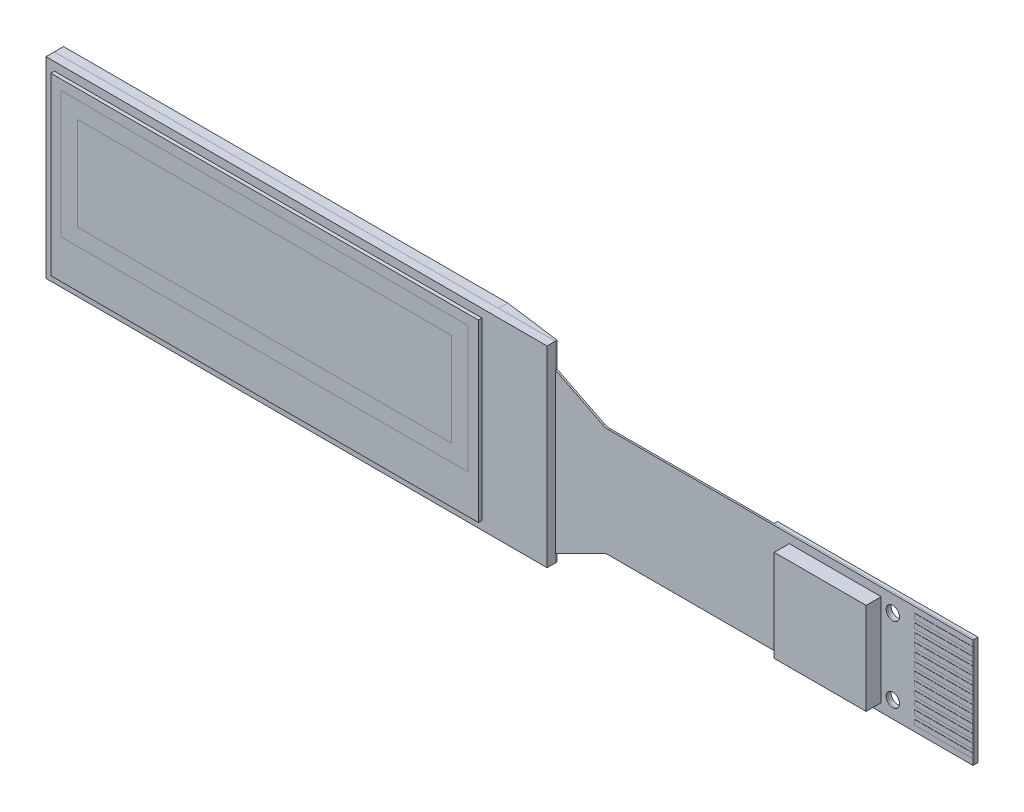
from build123d import *

# Parameters (mm, degrees)
SKETCH1_W                      = 26.6
SKETCH1_H                      = 11.5
SKETCH1_W_2                    = 25.6
SKETCH1_H_2                    = 10.5
SKETCH1_W_3                    = 24.384
SKETCH1_H_3                    = 7.584
SKETCH1_W_4                    = 22.384
SKETCH1_H_4                    = 5.584
SKETCH1_W_5                    = 3.4
TOP_GLASS_DEPTH                = 0.5
SKETCH1_3_W                    = 26.6
SKETCH1_3_H                    = 11.5
SKETCH1_3_W_2                  = 25.6
SKETCH1_3_H_2                  = 10.5
SKETCH1_3_W_3                  = 24.384
SKETCH1_3_H_3                  = 7.584
SKETCH1_3_W_4                  = 22.384
SKETCH1_3_H_4                  = 5.584
BACK_GLASS_DEPTH               = 0.55
POLARIZER_START                = 0.5
SKETCH1_4_W                    = 25.6
SKETCH1_4_H                    = 10.5
SKETCH1_4_W_2                  = 24.384
SKETCH1_4_H_2                  = 7.584
SKETCH1_4_W_3                  = 22.384
SKETCH1_4_H_3                  = 5.584
POLARIZER_DEPTH                = 0.21
SKETCH2_R                      = 0.4
FLEXIBLE_TAIL_DEPTH            = 0.1
STIFFENER_START                = -0.1
SKETCH2_4_W                    = 12
SKETCH2_4_H                    = 6.5
SKETCH2_4_R                    = 0.4
STIFFENER_DEPTH                = 0.2
SKETCH2_5_W                    = 3.5
SKETCH2_5_H                    = 0.3
PINS_DEPTH                     = 0.01
SKETCH2_6_W                    = 5.5
SKETCH2_6_H                    = 5.5
COMPONENTS_DEPTH               = 0.9
SILICON_GLUE_REACH             = 42.421
SILICON_GLUE_DIRECTION_2_REACH = 42.421


with BuildPart() as part:
    # Sketch1 → Top Glass (new body)
    # profile 1 of 5: a face of its own
    with BuildSketch(Plane.XY):
        with Locations((-1.7, 0)):
            Rectangle(SKETCH1_W, SKETCH1_H)
        with Locations((-1.7, 0)):
            Rectangle(SKETCH1_W_2, SKETCH1_H_2, mode=Mode.SUBTRACT)
    # profile 2 of 5: a face of its own
    with BuildSketch(Plane.XY):
        with Locations((-1.7, 0)):
            Rectangle(SKETCH1_W_2, SKETCH1_H_2)
        with Locations((-1.708, 0.858)):
            Rectangle(SKETCH1_W_3, SKETCH1_H_3, mode=Mode.SUBTRACT)
    # profile 3 of 5: a face of its own
    with BuildSketch(Plane.XY):
        with Locations((-1.708, 0.858)):
            Rectangle(SKETCH1_W_3, SKETCH1_H_3)
        with Locations((-1.708, 0.858)):
            Rectangle(SKETCH1_W_4, SKETCH1_H_4, mode=Mode.SUBTRACT)
    # profile 4 of 5: a face of its own
    with BuildSketch(Plane.XY):
        with Locations((-1.708, 0.858)):
            Rectangle(SKETCH1_W_4, SKETCH1_H_4)
    # profile 5 of 5: a face of its own
    with BuildSketch(Plane.XY):
        with Locations((13.3, 0)):
            Rectangle(SKETCH1_W_5, SKETCH1_H)
    extrude(amount=TOP_GLASS_DEPTH)

    # Sketch1_4 → Polarizer (add)
    # profile 1 of 3: a face of its own
    with BuildSketch(Plane.XY.offset(POLARIZER_START)):
        with Locations((-1.7, 0)):
            Rectangle(SKETCH1_4_W, SKETCH1_4_H)
        with Locations((-1.708, 0.858)):
            Rectangle(SKETCH1_4_W_2, SKETCH1_4_H_2, mode=Mode.SUBTRACT)
    # profile 2 of 3: a face of its own
    with BuildSketch(Plane.XY.offset(POLARIZER_START)):
        with Locations((-1.708, 0.858)):
            Rectangle(SKETCH1_4_W_2, SKETCH1_4_H_2)
        with Locations((-1.708, 0.858)):
            Rectangle(SKETCH1_4_W_3, SKETCH1_4_H_3, mode=Mode.SUBTRACT)
    # profile 3 of 3: a face of its own
    with BuildSketch(Plane.XY.offset(POLARIZER_START)):
        with Locations((-1.708, 0.858)):
            Rectangle(SKETCH1_4_W_3, SKETCH1_4_H_3)
    extrude(amount=POLARIZER_DEPTH)


with BuildPart() as body_2:
    # Sketch1_3 → Back Glass (new body)
    # profile 1 of 4: a face of its own
    with BuildSketch(Plane.XY):
        with Locations((-1.7, 0)):
            Rectangle(SKETCH1_3_W, SKETCH1_3_H)
        with Locations((-1.7, 0)):
            Rectangle(SKETCH1_3_W_2, SKETCH1_3_H_2, mode=Mode.SUBTRACT)
    # profile 2 of 4: a face of its own
    with BuildSketch(Plane.XY):
        with Locations((-1.7, 0)):
            Rectangle(SKETCH1_3_W_2, SKETCH1_3_H_2)
        with Locations((-1.708, 0.858)):
            Rectangle(SKETCH1_3_W_3, SKETCH1_3_H_3, mode=Mode.SUBTRACT)
    # profile 3 of 4: a face of its own
    with BuildSketch(Plane.XY):
        with Locations((-1.708, 0.858)):
            Rectangle(SKETCH1_3_W_3, SKETCH1_3_H_3)
        with Locations((-1.708, 0.858)):
            Rectangle(SKETCH1_3_W_4, SKETCH1_3_H_4, mode=Mode.SUBTRACT)
    # profile 4 of 4: a face of its own
    with BuildSketch(Plane.XY):
        with Locations((-1.708, 0.858)):
            Rectangle(SKETCH1_3_W_4, SKETCH1_3_H_4)
    extrude(amount=-BACK_GLASS_DEPTH)


with BuildPart() as body_3:
    # Sketch2 → Flexible Tail (new body)
    with BuildSketch(Plane.XY):
        with BuildLine():
            Line((40, 2.75), (18.177050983, 2.75))
            ThreePointArc((18.177050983, 2.75), (18.004736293, 2.770063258), (17.841640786, 2.829179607))
            Line((17.841640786, 2.829179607), (15, 4.25))
            Line((15, 4.25), (15, -5.25))
            Line((15, -5.25), (17.841640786, -3.829179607))
            ThreePointArc((17.841640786, -3.829179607), (18.004736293, -3.770063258), (18.177050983, -3.75))
            Line((18.177050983, -3.75), (40, -3.75))
            Line((40, -3.75), (40, 2.75))
        make_face()
        with Locations((35.2, 1.75)):
            Circle(SKETCH2_R, mode=Mode.SUBTRACT)
        with Locations((35.2, -2.75)):
            Circle(SKETCH2_R, mode=Mode.SUBTRACT)
    extrude(amount=-FLEXIBLE_TAIL_DEPTH)

    # Sketch2_5 → Pins (add)
    with BuildSketch(Plane.XY):
        with Locations((38.25, 2.25)):
            Rectangle(SKETCH2_5_W, SKETCH2_5_H)
        with Locations((38.25, 1.75)):
            Rectangle(SKETCH2_5_W, SKETCH2_5_H)
        with Locations((38.25, 1.25)):
            Rectangle(SKETCH2_5_W, SKETCH2_5_H)
        with Locations((38.25, 0.75)):
            Rectangle(SKETCH2_5_W, SKETCH2_5_H)
        with Locations((38.25, 0.25)):
            Rectangle(SKETCH2_5_W, SKETCH2_5_H)
        with Locations((38.25, -0.25)):
            Rectangle(SKETCH2_5_W, SKETCH2_5_H)
        with Locations((38.25, -0.75)):
            Rectangle(SKETCH2_5_W, SKETCH2_5_H)
        with Locations((38.25, -1.25)):
            Rectangle(SKETCH2_5_W, SKETCH2_5_H)
        with Locations((38.25, -1.75)):
            Rectangle(SKETCH2_5_W, SKETCH2_5_H)
        with Locations((38.25, -2.75)):
            Rectangle(SKETCH2_5_W, SKETCH2_5_H)
        with Locations((38.25, -3.25)):
            Rectangle(SKETCH2_5_W, SKETCH2_5_H)
        with Locations((38.25, -2.25)):
            Rectangle(SKETCH2_5_W, SKETCH2_5_H)
    extrude(amount=PINS_DEPTH)

    # Sketch2_6 → Components (add)
    with BuildSketch(Plane.XY):
        with Locations((31.75, -0.5)):
            Rectangle(SKETCH2_6_W, SKETCH2_6_H)
    extrude(amount=COMPONENTS_DEPTH)


with BuildPart() as body_4:
    # Sketch2_4 → Stiffener (new body)
    with BuildSketch(Plane.XY.offset(STIFFENER_START)):
        with Locations((34, -0.5)):
            Rectangle(SKETCH2_4_W, SKETCH2_4_H)
        with Locations((35.2, 1.75)):
            Circle(SKETCH2_4_R, mode=Mode.SUBTRACT)
        with Locations((35.2, -2.75)):
            Circle(SKETCH2_4_R, mode=Mode.SUBTRACT)
    extrude(amount=-STIFFENER_DEPTH)


with BuildPart() as body_5:

    # Silicon Glue: up to this face of the body (flat: up to its plane)
    silicon_glue_end = Plane(part.part.faces().sort_by_distance((0, 5.75, 0.25))[0])
    # Sketch3 → Silicon Glue (new, up to the picked face)
    with BuildSketch(Plane(origin=(0, 0, 0), x_dir=(1, 0, 0), z_dir=(0, 1, 0)), mode=Mode.PRIVATE) as silicon_glue_sk1:
        Polygon((11.6, 0.55), (15, 0.1), (15, 0), (11.6, 0), align=None)
    silicon_glue_tool1 = split(extrude(silicon_glue_sk1.sketch, amount=SILICON_GLUE_REACH, mode=Mode.PRIVATE), bisect_by=silicon_glue_end, keep=Keep.BOTH, mode=Mode.PRIVATE)
    add(silicon_glue_tool1.solids().sort_by(Axis((12.907692, 0, -0.188462), (0, 1, 0)))[0])


    # Silicon Glue direction 2: up to this face of the body (flat: up to its plane)
    silicon_glue_direction_2_end = Plane(part.part.faces().sort_by_distance((0, -5.75, 0.25))[0])
    # Sketch3 → Silicon Glue direction 2 (add, up to the picked face)
    with BuildSketch(Plane(origin=(0, 0, 0), x_dir=(1, 0, 0), z_dir=(0, 1, 0)), mode=Mode.PRIVATE) as silicon_glue_direction_2_sk1:
        Polygon((11.6, 0.55), (15, 0.1), (15, 0), (11.6, 0), align=None)
    silicon_glue_direction_2_tool1 = split(extrude(silicon_glue_direction_2_sk1.sketch, amount=-SILICON_GLUE_DIRECTION_2_REACH, mode=Mode.PRIVATE), bisect_by=silicon_glue_direction_2_end, keep=Keep.BOTH, mode=Mode.PRIVATE)
    add(silicon_glue_direction_2_tool1.solids().sort_by(Axis((12.907692, 0, -0.188462), (0, -1, 0)))[0])


solid = Compound([part.part, body_2.part, body_3.part, body_4.part, body_5.part])
